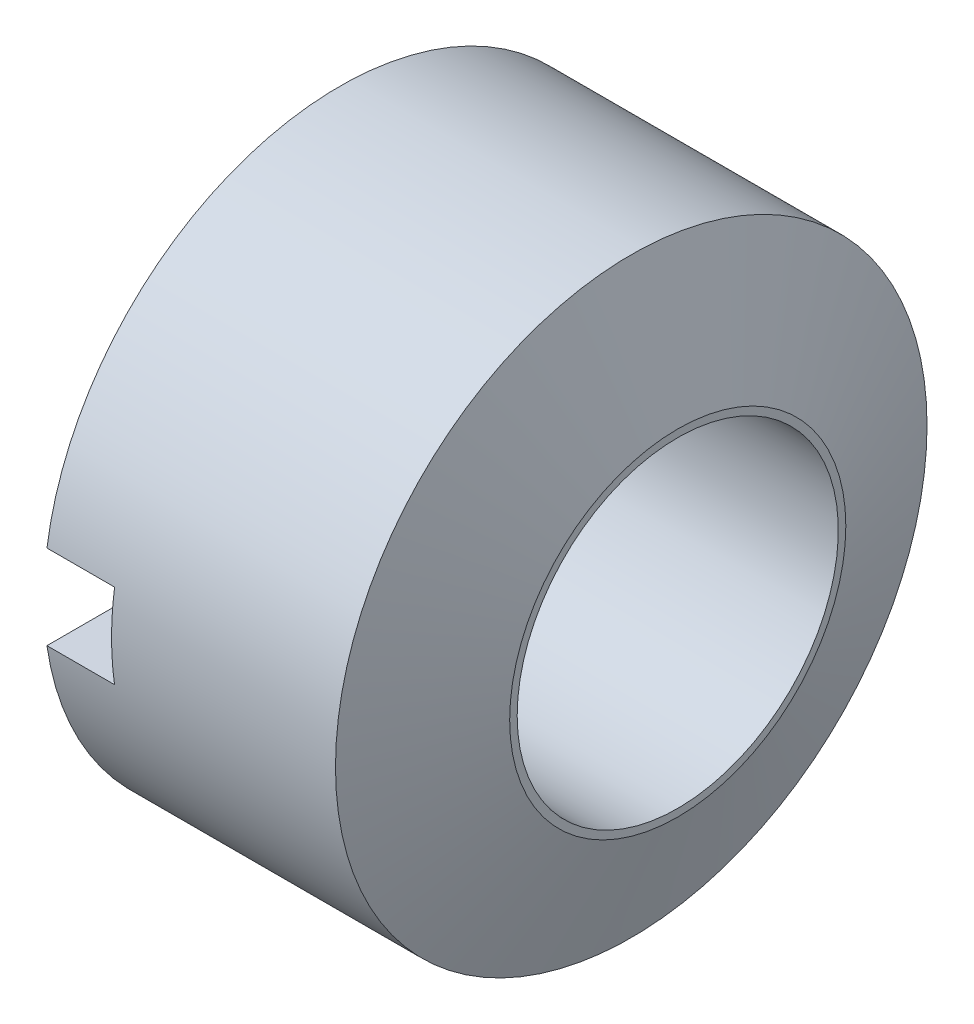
ISO-10303-21;
HEADER;
FILE_DESCRIPTION(('STEP AP214'),'2;1');
FILE_NAME('part.step','',(''),(''),'','','');
FILE_SCHEMA(('AUTOMOTIVE_DESIGN { 1 0 10303 214 1 1 1 1 }'));
ENDSEC;
DATA;
#1=APPLICATION_CONTEXT('core data for automotive mechanical design processes');
#2=APPLICATION_PROTOCOL_DEFINITION('international standard','automotive_design',2000,#1);
#3=PRODUCT_CONTEXT('',#1,'mechanical');
#4=PRODUCT('Part','Part','',(#3));
#5=PRODUCT_RELATED_PRODUCT_CATEGORY('part','',(#4));
#6=PRODUCT_DEFINITION_FORMATION('','',#4);
#7=PRODUCT_DEFINITION_CONTEXT('part definition',#1,'design');
#8=PRODUCT_DEFINITION('design','',#6,#7);
#9=PRODUCT_DEFINITION_SHAPE('','',#8);
#10=(LENGTH_UNIT() NAMED_UNIT(*) SI_UNIT(.MILLI.,.METRE.));
#11=(NAMED_UNIT(*) PLANE_ANGLE_UNIT() SI_UNIT($,.RADIAN.));
#12=(NAMED_UNIT(*) SI_UNIT($,.STERADIAN.) SOLID_ANGLE_UNIT());
#13=UNCERTAINTY_MEASURE_WITH_UNIT(LENGTH_MEASURE(1.E-05),#10,'distance_accuracy_value','');
#14=(GEOMETRIC_REPRESENTATION_CONTEXT(3) GLOBAL_UNCERTAINTY_ASSIGNED_CONTEXT((#13)) GLOBAL_UNIT_ASSIGNED_CONTEXT((#10,
#11,#12)) REPRESENTATION_CONTEXT('',''));
#15=CARTESIAN_POINT('',(0.,0.,0.));
#16=DIRECTION('',(0.,0.,1.));
#17=DIRECTION('',(1.,0.,0.));
#18=AXIS2_PLACEMENT_3D('',#15,#16,#17);
#19=CARTESIAN_POINT('',(9.849369,1.9,0.));
#20=DIRECTION('',(1.,0.,0.));
#21=DIRECTION('',(0.,0.,-1.));
#22=AXIS2_PLACEMENT_3D('',#19,#20,#21);
#23=PLANE('',#22);
#24=CARTESIAN_POINT('',(9.849369,0.,0.));
#25=DIRECTION('',(-1.,0.,0.));
#26=DIRECTION('',(0.,0.,1.));
#27=AXIS2_PLACEMENT_3D('',#24,#25,#26);
#28=CIRCLE('',#27,3.5);
#29=CARTESIAN_POINT('',(9.849369,0.500000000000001,3.46410161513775));
#30=VERTEX_POINT('',#29);
#31=CARTESIAN_POINT('',(9.849369,0.500000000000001,-3.46410161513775));
#32=VERTEX_POINT('',#31);
#33=EDGE_CURVE('E120',#30,#32,#28,.T.);
#34=ORIENTED_EDGE('',*,*,#33,.T.);
#35=DIRECTION('',(0.,0.,1.));
#36=VECTOR('',#35,1.);
#37=CARTESIAN_POINT('',(9.849369,0.500000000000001,-20.));
#38=LINE('',#37,#36);
#39=CARTESIAN_POINT('',(9.849369,0.500000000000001,-1.83303027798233));
#40=VERTEX_POINT('',#39);
#41=EDGE_CURVE('E157',#32,#40,#38,.T.);
#42=ORIENTED_EDGE('',*,*,#41,.T.);
#43=CARTESIAN_POINT('',(9.849369,0.,0.));
#44=DIRECTION('',(-1.,0.,0.));
#45=DIRECTION('',(0.,0.,1.));
#46=AXIS2_PLACEMENT_3D('',#43,#44,#45);
#47=CIRCLE('',#46,1.9);
#48=CARTESIAN_POINT('',(9.849369,0.500000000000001,1.83303027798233));
#49=VERTEX_POINT('',#48);
#50=EDGE_CURVE('E104',#49,#40,#47,.T.);
#51=ORIENTED_EDGE('',*,*,#50,.F.);
#52=EDGE_CURVE('E150',#49,#30,#38,.T.);
#53=ORIENTED_EDGE('',*,*,#52,.T.);
#54=EDGE_LOOP('',(#34,#42,#51,#53));
#55=FACE_BOUND('',#54,.T.);
#56=ADVANCED_FACE('F32',(#55),#23,.F.);
#57=CARTESIAN_POINT('',(0.,0.,0.));
#58=DIRECTION('',(-1.,0.,0.));
#59=DIRECTION('',(0.,0.,1.));
#60=AXIS2_PLACEMENT_3D('',#57,#58,#59);
#61=CYLINDRICAL_SURFACE('',#60,1.9);
#62=CARTESIAN_POINT('',(13.849369,0.,0.));
#63=DIRECTION('',(-1.,0.,0.));
#64=DIRECTION('',(0.,0.,1.));
#65=AXIS2_PLACEMENT_3D('',#62,#63,#64);
#66=CIRCLE('',#65,1.9);
#67=CARTESIAN_POINT('',(13.849369,0.,1.9));
#68=VERTEX_POINT('',#67);
#69=EDGE_CURVE('E168',#68,#68,#66,.T.);
#70=ORIENTED_EDGE('',*,*,#69,.F.);
#71=EDGE_LOOP('',(#70));
#72=FACE_BOUND('',#71,.T.);
#73=CARTESIAN_POINT('',(10.649369,0.,0.));
#74=DIRECTION('',(1.,0.,0.));
#75=DIRECTION('',(0.,0.,-1.));
#76=AXIS2_PLACEMENT_3D('',#73,#74,#75);
#77=CIRCLE('',#76,1.9);
#78=CARTESIAN_POINT('',(10.649369,-0.499999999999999,1.83303027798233));
#79=VERTEX_POINT('',#78);
#80=CARTESIAN_POINT('',(10.649369,0.500000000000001,1.83303027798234));
#81=VERTEX_POINT('',#80);
#82=EDGE_CURVE('E163',#79,#81,#77,.F.);
#83=ORIENTED_EDGE('',*,*,#82,.T.);
#84=DIRECTION('',(-1.,0.,0.));
#85=VECTOR('',#84,1.);
#86=CARTESIAN_POINT('',(0.,0.500000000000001,1.83303027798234));
#87=LINE('',#86,#85);
#88=EDGE_CURVE('E146',#81,#49,#87,.T.);
#89=ORIENTED_EDGE('',*,*,#88,.T.);
#90=ORIENTED_EDGE('',*,*,#50,.T.);
#91=DIRECTION('',(-1.,0.,0.));
#92=VECTOR('',#91,1.);
#93=CARTESIAN_POINT('',(0.,0.500000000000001,-1.83303027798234));
#94=LINE('',#93,#92);
#95=CARTESIAN_POINT('',(10.649369,0.500000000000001,-1.83303027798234));
#96=VERTEX_POINT('',#95);
#97=EDGE_CURVE('E165',#40,#96,#94,.F.);
#98=ORIENTED_EDGE('',*,*,#97,.T.);
#99=CARTESIAN_POINT('',(10.649369,-0.499999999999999,-1.83303027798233));
#100=VERTEX_POINT('',#99);
#101=EDGE_CURVE('E160',#96,#100,#77,.F.);
#102=ORIENTED_EDGE('',*,*,#101,.T.);
#103=DIRECTION('',(-1.,0.,0.));
#104=VECTOR('',#103,1.);
#105=CARTESIAN_POINT('',(0.,-0.500000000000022,-1.83303027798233));
#106=LINE('',#105,#104);
#107=CARTESIAN_POINT('',(9.849369,-0.500000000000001,-1.83303027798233));
#108=VERTEX_POINT('',#107);
#109=EDGE_CURVE('E154',#100,#108,#106,.T.);
#110=ORIENTED_EDGE('',*,*,#109,.T.);
#111=CARTESIAN_POINT('',(9.849369,-0.500000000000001,1.83303027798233));
#112=VERTEX_POINT('',#111);
#113=EDGE_CURVE('E112',#108,#112,#47,.T.);
#114=ORIENTED_EDGE('',*,*,#113,.T.);
#115=DIRECTION('',(-1.,0.,0.));
#116=VECTOR('',#115,1.);
#117=CARTESIAN_POINT('',(0.,-0.500000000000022,1.83303027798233));
#118=LINE('',#117,#116);
#119=EDGE_CURVE('E156',#112,#79,#118,.F.);
#120=ORIENTED_EDGE('',*,*,#119,.T.);
#121=EDGE_LOOP('',(#83,#89,#90,#98,#102,#110,#114,#120));
#122=FACE_BOUND('',#121,.T.);
#123=ADVANCED_FACE('F34',(#72,#122),#61,.F.);
#124=CARTESIAN_POINT('',(9.849369,-0.500000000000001,-3.46410161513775));
#125=VERTEX_POINT('',#124);
#126=CARTESIAN_POINT('',(9.849369,-0.500000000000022,3.46410161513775));
#127=VERTEX_POINT('',#126);
#128=EDGE_CURVE('E110',#125,#127,#28,.T.);
#129=ORIENTED_EDGE('',*,*,#128,.T.);
#130=DIRECTION('',(0.,0.,1.));
#131=VECTOR('',#130,1.);
#132=CARTESIAN_POINT('',(9.849369,-0.500000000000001,-20.));
#133=LINE('',#132,#131);
#134=EDGE_CURVE('E55',#112,#127,#133,.T.);
#135=ORIENTED_EDGE('',*,*,#134,.F.);
#136=ORIENTED_EDGE('',*,*,#113,.F.);
#137=EDGE_CURVE('E98',#125,#108,#133,.T.);
#138=ORIENTED_EDGE('',*,*,#137,.F.);
#139=EDGE_LOOP('',(#129,#135,#136,#138));
#140=FACE_BOUND('',#139,.T.);
#141=ADVANCED_FACE('F109',(#140),#23,.F.);
#142=CARTESIAN_POINT('',(0.,0.,0.));
#143=DIRECTION('',(-1.,0.,0.));
#144=DIRECTION('',(0.,0.,1.));
#145=AXIS2_PLACEMENT_3D('',#142,#143,#144);
#146=CYLINDRICAL_SURFACE('',#145,3.5);
#147=ORIENTED_EDGE('',*,*,#33,.F.);
#148=DIRECTION('',(-1.,0.,0.));
#149=VECTOR('',#148,1.);
#150=CARTESIAN_POINT('',(0.,0.500000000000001,3.46410161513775));
#151=LINE('',#150,#149);
#152=CARTESIAN_POINT('',(10.649369,0.500000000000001,3.46410161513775));
#153=VERTEX_POINT('',#152);
#154=EDGE_CURVE('E11',#30,#153,#151,.F.);
#155=ORIENTED_EDGE('',*,*,#154,.T.);
#156=CARTESIAN_POINT('',(10.649369,0.,0.));
#157=DIRECTION('',(1.,0.,0.));
#158=DIRECTION('',(0.,0.,-1.));
#159=AXIS2_PLACEMENT_3D('',#156,#157,#158);
#160=CIRCLE('',#159,3.5);
#161=CARTESIAN_POINT('',(10.649369,-0.499999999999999,3.46410161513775));
#162=VERTEX_POINT('',#161);
#163=EDGE_CURVE('E40',#153,#162,#160,.T.);
#164=ORIENTED_EDGE('',*,*,#163,.T.);
#165=DIRECTION('',(-1.,0.,0.));
#166=VECTOR('',#165,1.);
#167=CARTESIAN_POINT('',(0.,-0.500000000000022,3.46410161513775));
#168=LINE('',#167,#166);
#169=EDGE_CURVE('E119',#162,#127,#168,.T.);
#170=ORIENTED_EDGE('',*,*,#169,.T.);
#171=ORIENTED_EDGE('',*,*,#128,.F.);
#172=DIRECTION('',(-1.,0.,0.));
#173=VECTOR('',#172,1.);
#174=CARTESIAN_POINT('',(0.,-0.500000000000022,-3.46410161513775));
#175=LINE('',#174,#173);
#176=CARTESIAN_POINT('',(10.649369,-0.500000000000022,-3.46410161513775));
#177=VERTEX_POINT('',#176);
#178=EDGE_CURVE('E95',#125,#177,#175,.F.);
#179=ORIENTED_EDGE('',*,*,#178,.T.);
#180=CARTESIAN_POINT('',(10.649369,0.500000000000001,-3.46410161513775));
#181=VERTEX_POINT('',#180);
#182=EDGE_CURVE('E103',#177,#181,#160,.T.);
#183=ORIENTED_EDGE('',*,*,#182,.T.);
#184=DIRECTION('',(-1.,0.,0.));
#185=VECTOR('',#184,1.);
#186=CARTESIAN_POINT('',(0.,0.500000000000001,-3.46410161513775));
#187=LINE('',#186,#185);
#188=EDGE_CURVE('E132',#181,#32,#187,.T.);
#189=ORIENTED_EDGE('',*,*,#188,.T.);
#190=EDGE_LOOP('',(#147,#155,#164,#170,#171,#179,#183,#189));
#191=FACE_BOUND('',#190,.T.);
#192=CARTESIAN_POINT('',(13.299369,0.,0.));
#193=DIRECTION('',(-1.,0.,0.));
#194=DIRECTION('',(0.,0.,1.));
#195=AXIS2_PLACEMENT_3D('',#192,#193,#194);
#196=CIRCLE('',#195,3.5);
#197=CARTESIAN_POINT('',(13.299369,0.,3.5));
#198=VERTEX_POINT('',#197);
#199=EDGE_CURVE('E121',#198,#198,#196,.T.);
#200=ORIENTED_EDGE('',*,*,#199,.T.);
#201=EDGE_LOOP('',(#200));
#202=FACE_BOUND('',#201,.T.);
#203=ADVANCED_FACE('F116',(#191,#202),#146,.T.);
#204=CARTESIAN_POINT('',(13.849369,0.,0.));
#205=DIRECTION('',(-1.,0.,0.));
#206=DIRECTION('',(0.,0.,1.));
#207=AXIS2_PLACEMENT_3D('',#204,#205,#206);
#208=CONICAL_SURFACE('',#207,1.98888741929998,1.22173047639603);
#209=ORIENTED_EDGE('',*,*,#199,.F.);
#210=EDGE_LOOP('',(#209));
#211=FACE_BOUND('',#210,.T.);
#212=CARTESIAN_POINT('',(13.849369,0.,0.));
#213=DIRECTION('',(-1.,0.,0.));
#214=DIRECTION('',(0.,0.,1.));
#215=AXIS2_PLACEMENT_3D('',#212,#213,#214);
#216=CIRCLE('',#215,1.98888741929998);
#217=CARTESIAN_POINT('',(13.849369,0.,1.98888741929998));
#218=VERTEX_POINT('',#217);
#219=EDGE_CURVE('E125',#218,#218,#216,.T.);
#220=ORIENTED_EDGE('',*,*,#219,.T.);
#221=EDGE_LOOP('',(#220));
#222=FACE_BOUND('',#221,.T.);
#223=ADVANCED_FACE('F173',(#211,#222),#208,.T.);
#224=CARTESIAN_POINT('',(13.849369,1.9,0.));
#225=DIRECTION('',(-1.,0.,0.));
#226=DIRECTION('',(0.,0.,1.));
#227=AXIS2_PLACEMENT_3D('',#224,#225,#226);
#228=PLANE('',#227);
#229=ORIENTED_EDGE('',*,*,#219,.F.);
#230=EDGE_LOOP('',(#229));
#231=FACE_BOUND('',#230,.T.);
#232=ORIENTED_EDGE('',*,*,#69,.T.);
#233=EDGE_LOOP('',(#232));
#234=FACE_BOUND('',#233,.T.);
#235=ADVANCED_FACE('F175',(#231,#234),#228,.F.);
#236=CARTESIAN_POINT('',(9.849369,-0.500000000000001,-20.));
#237=DIRECTION('',(0.,-1.,0.));
#238=DIRECTION('',(1.,0.,0.));
#239=AXIS2_PLACEMENT_3D('',#236,#237,#238);
#240=PLANE('',#239);
#241=DIRECTION('',(0.,0.,1.));
#242=VECTOR('',#241,1.);
#243=CARTESIAN_POINT('',(10.649369,-0.499999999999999,-20.));
#244=LINE('',#243,#242);
#245=EDGE_CURVE('E47',#177,#100,#244,.T.);
#246=ORIENTED_EDGE('',*,*,#245,.F.);
#247=ORIENTED_EDGE('',*,*,#178,.F.);
#248=ORIENTED_EDGE('',*,*,#137,.T.);
#249=ORIENTED_EDGE('',*,*,#109,.F.);
#250=EDGE_LOOP('',(#246,#247,#248,#249));
#251=FACE_BOUND('',#250,.T.);
#252=ADVANCED_FACE('F97',(#251),#240,.F.);
#253=CARTESIAN_POINT('',(10.649369,0.500000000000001,-20.));
#254=DIRECTION('',(1.,0.,0.));
#255=DIRECTION('',(0.,0.,-1.));
#256=AXIS2_PLACEMENT_3D('',#253,#254,#255);
#257=PLANE('',#256);
#258=DIRECTION('',(0.,0.,1.));
#259=VECTOR('',#258,1.);
#260=CARTESIAN_POINT('',(10.649369,0.500000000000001,-20.));
#261=LINE('',#260,#259);
#262=EDGE_CURVE('E147',#181,#96,#261,.T.);
#263=ORIENTED_EDGE('',*,*,#262,.F.);
#264=ORIENTED_EDGE('',*,*,#182,.F.);
#265=ORIENTED_EDGE('',*,*,#245,.T.);
#266=ORIENTED_EDGE('',*,*,#101,.F.);
#267=EDGE_LOOP('',(#263,#264,#265,#266));
#268=FACE_BOUND('',#267,.T.);
#269=ADVANCED_FACE('F187',(#268),#257,.F.);
#270=CARTESIAN_POINT('',(9.849369,0.500000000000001,-20.));
#271=DIRECTION('',(0.,1.,0.));
#272=DIRECTION('',(0.,0.,1.));
#273=AXIS2_PLACEMENT_3D('',#270,#271,#272);
#274=PLANE('',#273);
#275=ORIENTED_EDGE('',*,*,#41,.F.);
#276=ORIENTED_EDGE('',*,*,#188,.F.);
#277=ORIENTED_EDGE('',*,*,#262,.T.);
#278=ORIENTED_EDGE('',*,*,#97,.F.);
#279=EDGE_LOOP('',(#275,#276,#277,#278));
#280=FACE_BOUND('',#279,.T.);
#281=ADVANCED_FACE('F191',(#280),#274,.F.);
#282=EDGE_CURVE('E139',#81,#153,#261,.T.);
#283=ORIENTED_EDGE('',*,*,#282,.T.);
#284=ORIENTED_EDGE('',*,*,#154,.F.);
#285=ORIENTED_EDGE('',*,*,#52,.F.);
#286=ORIENTED_EDGE('',*,*,#88,.F.);
#287=EDGE_LOOP('',(#283,#284,#285,#286));
#288=FACE_BOUND('',#287,.T.);
#289=ADVANCED_FACE('F143',(#288),#274,.F.);
#290=EDGE_CURVE('E113',#79,#162,#244,.T.);
#291=ORIENTED_EDGE('',*,*,#290,.T.);
#292=ORIENTED_EDGE('',*,*,#163,.F.);
#293=ORIENTED_EDGE('',*,*,#282,.F.);
#294=ORIENTED_EDGE('',*,*,#82,.F.);
#295=EDGE_LOOP('',(#291,#292,#293,#294));
#296=FACE_BOUND('',#295,.T.);
#297=ADVANCED_FACE('F138',(#296),#257,.F.);
#298=ORIENTED_EDGE('',*,*,#134,.T.);
#299=ORIENTED_EDGE('',*,*,#169,.F.);
#300=ORIENTED_EDGE('',*,*,#290,.F.);
#301=ORIENTED_EDGE('',*,*,#119,.F.);
#302=EDGE_LOOP('',(#298,#299,#300,#301));
#303=FACE_BOUND('',#302,.T.);
#304=ADVANCED_FACE('F184',(#303),#240,.F.);
#305=CLOSED_SHELL('',(#56,#123,#141,#203,#223,#235,#252,#269,#281,#289,#297,#304));
#306=MANIFOLD_SOLID_BREP('B2',#305);
#307=ADVANCED_BREP_SHAPE_REPRESENTATION('',(#18,#306),#14);
#308=SHAPE_DEFINITION_REPRESENTATION(#9,#307);
ENDSEC;
END-ISO-10303-21;
